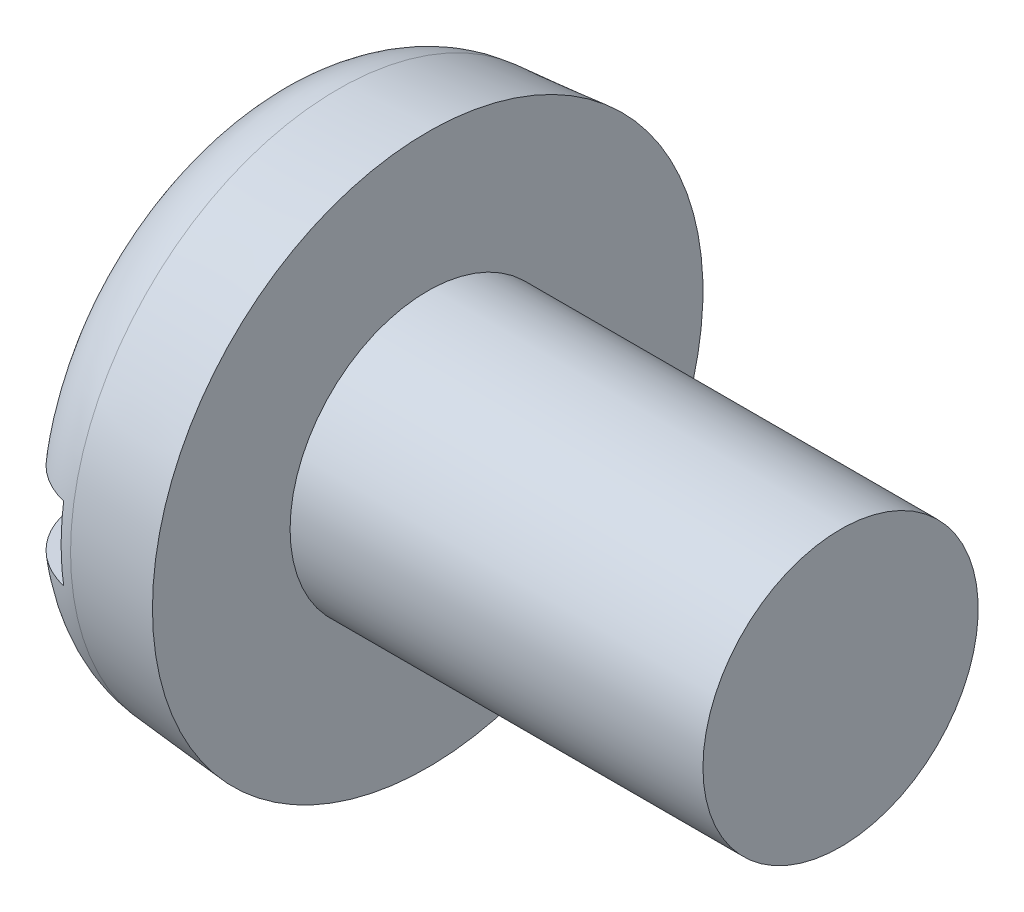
from build123d import *

# Parameters (mm, degrees)
FILLET2_R  = 1.8
SKETCH2_W  = 12
SKETCH2_H  = 1.6
SLOT_DEPTH = 1.4


with BuildPart() as part:
    # BodySke → Base-Revolve (revolve)
    with BuildSketch(Plane.XY, mode=Mode.PRIVATE) as base_revolve_sk:
        Polygon((3.6, 3), (3.6, 6), (0, 5.685040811), (0, 0), (12.6, 0), (12.6, 3), align=None)
    revolve(base_revolve_sk.sketch.rotate(Axis((-25.4, 0, 0), (1, 0, 0)), 90), axis=Axis((-25.4, 0, 0), (1, 0, 0)))

    # Fillet2
    fillet2_edges = [part.edges().sort_by_distance(p)[0] for p in [
        (0, 0, -5.685040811),
    ]]
    fillet(fillet2_edges, radius=FILLET2_R)

    # Sketch2 → Slot (cut)
    with BuildSketch(Plane(origin=(0, 0, 0), x_dir=(0, 0, -1), z_dir=(1, 0, 0))):
        Rectangle(SKETCH2_W, SKETCH2_H)
    extrude(amount=SLOT_DEPTH, mode=Mode.SUBTRACT)


solid = part.part
